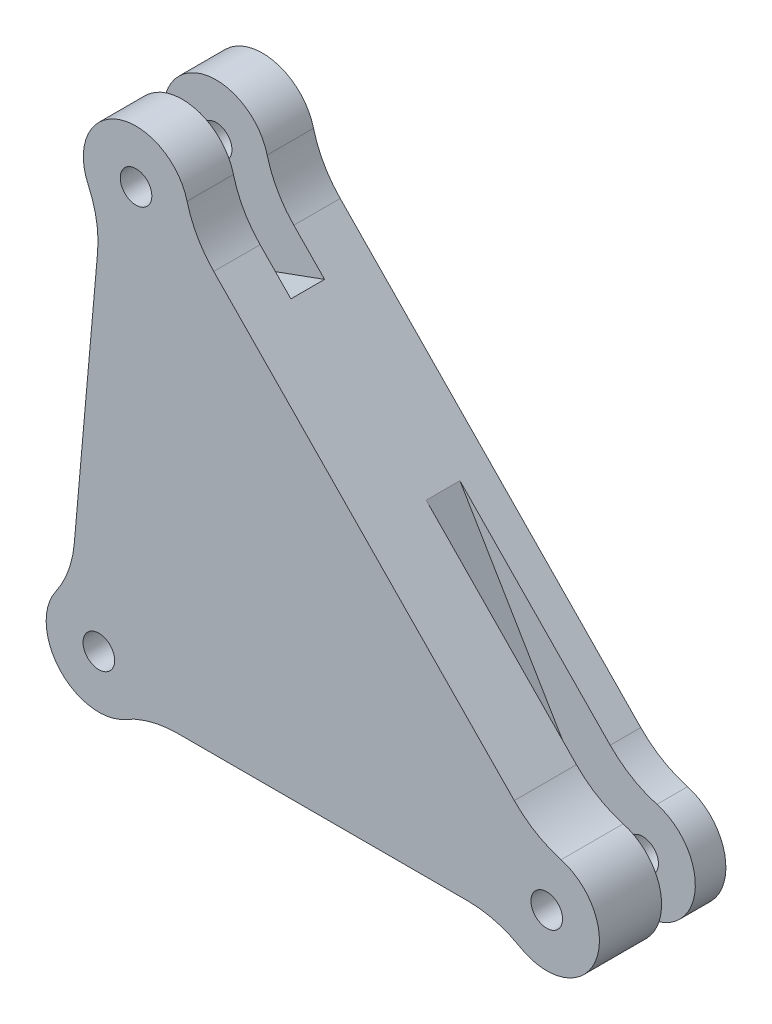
from build123d import *

# Parameters (mm, degrees)
ESQUISSE1_R                  = 1.5
BOSS_EXTRU_1_DEPTH           = 12
ENL_V_MAT_EXTRU_3_DEPTH      = 1.6
ENL_V_MAT_EXTRU_3_DEPTH_BACK = 1.6
ESQUISSE5_R                  = 1.5
ENL_V_START                  = -3.2
ESQUISSE7_R                  = 1.5
ENL_V_MAT_EXTRU_4_DEPTH      = 3.2
ESQUISSE8_R                  = 1.5
ENL_V_MAT_EXTRU_5_DEPTH      = 3.2
CONG_1_R                     = 10
ENL_V_MAT_EXTRU_7_DEPTH      = 6
CHANFREIN1_SIZE              = 1


with BuildPart() as part:
    # Esquisse1 → Boss.-Extru.1 (new body)
    with BuildSketch(Plane.XY):
        with BuildLine():
            Line((-0.646582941, 4.958016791), (-34.030833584, 39.168129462))
            ThreePointArc((-34.030833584, 39.168129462), (-40.650921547, 44.645196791), (-42.31197155, 36.215206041))
            Line((-42.31197155, 36.215206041), (-45.136318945, 4.248508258))
            ThreePointArc((-45.136318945, 4.248508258), (-46.187834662, -3.376370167), (-38.5, -3))
            Line((-38.5, -3), (-4, -3))
            ThreePointArc((-4, -3), (4.607623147, -1.941599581), (-0.646582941, 4.958016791))
        make_face()
        Circle(ESQUISSE1_R, mode=Mode.SUBTRACT)
        with Locations((-42.5, 0)):
            Circle(ESQUISSE1_R, mode=Mode.SUBTRACT)
        with Locations((-38.971572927, 39.935654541)):
            Circle(ESQUISSE1_R, mode=Mode.SUBTRACT)
    extrude(amount=BOSS_EXTRU_1_DEPTH)

    # Esquisse5 → Enl_v. mat.-Extru.3 (cut, two sides: drawn at the far end of the back side and taken through both)
    with BuildSketch(Plane.XY.offset(6).offset(-ENL_V_MAT_EXTRU_3_DEPTH_BACK)):
        with BuildLine():
            Line((-38.971572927, 29.935654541), (-28.677518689, 33.682383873))
            Line((-28.677518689, 33.682383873), (-34.030833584, 39.168129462))
            ThreePointArc((-34.030833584, 39.168129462), (-40.650921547, 44.645196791), (-42.31197155, 36.215206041))
            Line((-42.31197155, 36.215206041), (-42.996211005, 28.470806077))
            Line((-42.996211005, 28.470806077), (-38.971572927, 29.935654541))
        make_face()
        with Locations((-38.971572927, 39.935654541)):
            Circle(ESQUISSE5_R, mode=Mode.SUBTRACT)
    extrude(amount=ENL_V_MAT_EXTRU_3_DEPTH + ENL_V_MAT_EXTRU_3_DEPTH_BACK, mode=Mode.SUBTRACT)

    # Esquisse7 → Enl_v. mat.-Extru.4 (cut)
    with BuildSketch(Plane.XY.offset(6.1).offset(ENL_V_START)):
        with BuildLine():
            Line((-37.61277286, 4.285441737), (-43.724145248, 20.231857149))
            Line((-43.724145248, 20.231857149), (-45.136318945, 4.248508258))
            ThreePointArc((-45.136318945, 4.248508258), (-46.187834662, -3.376370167), (-38.5, -3))
            Line((-38.5, -3), (-21.25, -3))
            Line((-21.25, -3), (-37.61277286, 4.285441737))
        make_face()
        with Locations((-42.5, 0)):
            Circle(ESQUISSE7_R, mode=Mode.SUBTRACT)
    extrude(amount=ENL_V_MAT_EXTRU_4_DEPTH, mode=Mode.SUBTRACT)

    # Esquisse8 → Enl_v. mat.-Extru.5 (cut)
    with BuildSketch(Plane.XY.offset(6.1).offset(ENL_V_START)):
        with BuildLine():
            Line((-5.899090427, 2.729602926), (-17.338708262, 22.063073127))
            Line((-17.338708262, 22.063073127), (-0.646582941, 4.958016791))
            ThreePointArc((-0.646582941, 4.958016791), (4.607623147, -1.941599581), (-4, -3))
            Line((-4, -3), (-21.25, -3))
            Line((-21.25, -3), (-5.899090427, 2.729602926))
        make_face()
        Circle(ESQUISSE8_R, mode=Mode.SUBTRACT)
    extrude(amount=ENL_V_MAT_EXTRU_5_DEPTH, mode=Mode.SUBTRACT)

    # Cong_1
    cong_1_edges = [part.edges().sort_by_distance(p)[0] for p in [
        (-0.646582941, 4.958016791, 9.05),
        (-4, -3, 9.05),
        (-38.5, -3, 9.05),
        (-45.136318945, 4.248508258, 9.05),
        (-42.31197155, 36.215206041, 9.8),
        (-34.030833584, 39.168129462, 9.8),
        (-42.31197155, 36.215206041, 2.2),
        (-34.030833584, 39.168129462, 2.2),
        (-38.5, -3, 1.45),
        (-45.136318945, 4.248508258, 1.45),
        (-0.646582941, 4.958016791, 1.45),
        (-4, -3, 1.45),
    ]]
    fillet(cong_1_edges, radius=CONG_1_R)

    # Esquisse9 → Enl_v. mat.-Extru.7 (cut)
    with BuildSketch(Plane.XY.offset(9.3)):
        with BuildLine():
            Line((-44.836912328, 7.640719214), (-55.016685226, 7.640719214))
            Line((-55.016685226, 7.640719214), (-55.016685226, -12.359280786))
            Line((-55.016685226, -12.359280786), (-35.016685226, -12.359280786))
            Line((-35.016685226, -12.359280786), (-35.016685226, -3))
            ThreePointArc((-35.016685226, -3), (-42.435681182, 0.004933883), (-44.836912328, 7.640719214))
        make_face()
    extrude(amount=-ENL_V_MAT_EXTRU_7_DEPTH, mode=Mode.SUBTRACT)

    # Chanfrein1
    chanfrein1_edges = [part.edges().sort_by_distance(p)[0] for p in [
        (-45.476973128, 4.958369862, 9.3),
        (-37.85867773, -3.412347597, 9.3),
        (-46.187834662, -3.376370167, 9.3),
    ]]
    chamfer(chanfrein1_edges, length=CHANFREIN1_SIZE)


solid = part.part
